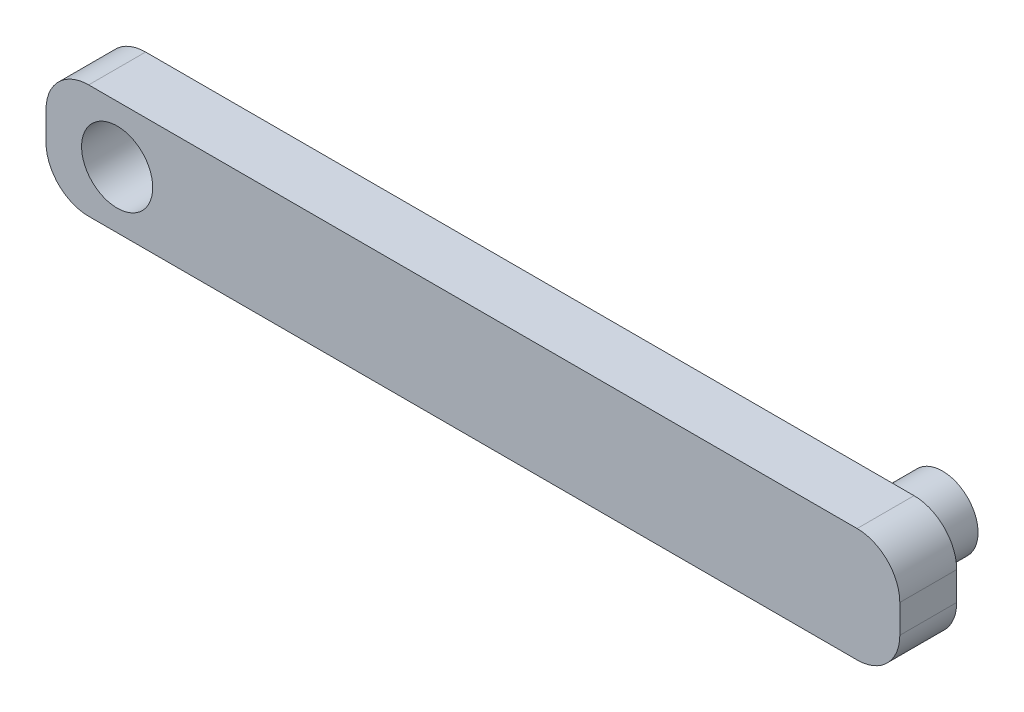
ISO-10303-21;
HEADER;
FILE_DESCRIPTION(('STEP AP214'),'2;1');
FILE_NAME('part.step','',(''),(''),'','','');
FILE_SCHEMA(('AUTOMOTIVE_DESIGN { 1 0 10303 214 1 1 1 1 }'));
ENDSEC;
DATA;
#1=APPLICATION_CONTEXT('core data for automotive mechanical design processes');
#2=APPLICATION_PROTOCOL_DEFINITION('international standard','automotive_design',2000,#1);
#3=PRODUCT_CONTEXT('',#1,'mechanical');
#4=PRODUCT('Part','Part','',(#3));
#5=PRODUCT_RELATED_PRODUCT_CATEGORY('part','',(#4));
#6=PRODUCT_DEFINITION_FORMATION('','',#4);
#7=PRODUCT_DEFINITION_CONTEXT('part definition',#1,'design');
#8=PRODUCT_DEFINITION('design','',#6,#7);
#9=PRODUCT_DEFINITION_SHAPE('','',#8);
#10=(LENGTH_UNIT() NAMED_UNIT(*) SI_UNIT(.MILLI.,.METRE.));
#11=(NAMED_UNIT(*) PLANE_ANGLE_UNIT() SI_UNIT($,.RADIAN.));
#12=(NAMED_UNIT(*) SI_UNIT($,.STERADIAN.) SOLID_ANGLE_UNIT());
#13=UNCERTAINTY_MEASURE_WITH_UNIT(LENGTH_MEASURE(1.E-05),#10,'distance_accuracy_value','');
#14=(GEOMETRIC_REPRESENTATION_CONTEXT(3) GLOBAL_UNCERTAINTY_ASSIGNED_CONTEXT((#13)) GLOBAL_UNIT_ASSIGNED_CONTEXT((#10,
#11,#12)) REPRESENTATION_CONTEXT('',''));
#15=CARTESIAN_POINT('',(0.,0.,0.));
#16=DIRECTION('',(0.,0.,1.));
#17=DIRECTION('',(1.,0.,0.));
#18=AXIS2_PLACEMENT_3D('',#15,#16,#17);
#19=CARTESIAN_POINT('',(996.866139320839,42.0947073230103,0.));
#20=DIRECTION('',(0.,0.,-1.));
#21=DIRECTION('',(-1.,0.,0.));
#22=AXIS2_PLACEMENT_3D('',#19,#20,#21);
#23=PLANE('',#22);
#24=CARTESIAN_POINT('',(996.866139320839,42.0947073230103,0.));
#25=DIRECTION('',(0.,0.,1.));
#26=DIRECTION('',(-1.,0.,0.));
#27=AXIS2_PLACEMENT_3D('',#24,#25,#26);
#28=CIRCLE('',#27,15.);
#29=CARTESIAN_POINT('',(1011.86613932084,42.0947073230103,0.));
#30=VERTEX_POINT('',#29);
#31=CARTESIAN_POINT('',(996.866139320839,57.0947073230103,0.));
#32=VERTEX_POINT('',#31);
#33=EDGE_CURVE('E102',#30,#32,#28,.T.);
#34=ORIENTED_EDGE('',*,*,#33,.F.);
#35=DIRECTION('',(0.,1.,0.));
#36=VECTOR('',#35,1.);
#37=CARTESIAN_POINT('',(1011.86613932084,42.0947073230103,0.));
#38=LINE('',#37,#36);
#39=CARTESIAN_POINT('',(1011.86613932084,32.0947073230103,0.));
#40=VERTEX_POINT('',#39);
#41=EDGE_CURVE('E132',#40,#30,#38,.T.);
#42=ORIENTED_EDGE('',*,*,#41,.F.);
#43=CARTESIAN_POINT('',(996.866139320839,32.0947073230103,0.));
#44=DIRECTION('',(0.,0.,1.));
#45=DIRECTION('',(1.,0.,0.));
#46=AXIS2_PLACEMENT_3D('',#43,#44,#45);
#47=CIRCLE('',#46,15.);
#48=CARTESIAN_POINT('',(996.866139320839,17.0947073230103,0.));
#49=VERTEX_POINT('',#48);
#50=EDGE_CURVE('E130',#49,#40,#47,.T.);
#51=ORIENTED_EDGE('',*,*,#50,.F.);
#52=DIRECTION('',(1.,0.,0.));
#53=VECTOR('',#52,1.);
#54=CARTESIAN_POINT('',(726.866139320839,17.0947073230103,0.));
#55=LINE('',#54,#53);
#56=CARTESIAN_POINT('',(726.866139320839,17.0947073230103,0.));
#57=VERTEX_POINT('',#56);
#58=EDGE_CURVE('E128',#57,#49,#55,.T.);
#59=ORIENTED_EDGE('',*,*,#58,.F.);
#60=CARTESIAN_POINT('',(726.866139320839,32.0947073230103,0.));
#61=DIRECTION('',(0.,0.,1.));
#62=DIRECTION('',(1.,0.,0.));
#63=AXIS2_PLACEMENT_3D('',#60,#61,#62);
#64=CIRCLE('',#63,15.);
#65=CARTESIAN_POINT('',(711.866139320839,32.0947073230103,0.));
#66=VERTEX_POINT('',#65);
#67=EDGE_CURVE('E126',#66,#57,#64,.T.);
#68=ORIENTED_EDGE('',*,*,#67,.F.);
#69=DIRECTION('',(0.,-1.,0.));
#70=VECTOR('',#69,1.);
#71=CARTESIAN_POINT('',(711.866139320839,42.0947073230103,0.));
#72=LINE('',#71,#70);
#73=CARTESIAN_POINT('',(711.866139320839,42.0947073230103,0.));
#74=VERTEX_POINT('',#73);
#75=EDGE_CURVE('E124',#74,#66,#72,.T.);
#76=ORIENTED_EDGE('',*,*,#75,.F.);
#77=CARTESIAN_POINT('',(726.866139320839,42.0947073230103,0.));
#78=DIRECTION('',(0.,0.,1.));
#79=DIRECTION('',(1.,0.,0.));
#80=AXIS2_PLACEMENT_3D('',#77,#78,#79);
#81=CIRCLE('',#80,15.);
#82=CARTESIAN_POINT('',(726.866139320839,57.0947073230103,0.));
#83=VERTEX_POINT('',#82);
#84=EDGE_CURVE('E104',#83,#74,#81,.T.);
#85=ORIENTED_EDGE('',*,*,#84,.F.);
#86=DIRECTION('',(-1.,0.,0.));
#87=VECTOR('',#86,1.);
#88=CARTESIAN_POINT('',(726.866139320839,57.0947073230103,0.));
#89=LINE('',#88,#87);
#90=EDGE_CURVE('E98',#32,#83,#89,.T.);
#91=ORIENTED_EDGE('',*,*,#90,.F.);
#92=EDGE_LOOP('',(#34,#42,#51,#59,#68,#76,#85,#91));
#93=FACE_BOUND('',#92,.T.);
#94=CARTESIAN_POINT('',(736.866139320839,37.0947073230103,0.));
#95=DIRECTION('',(0.,0.,1.));
#96=DIRECTION('',(1.,0.,0.));
#97=AXIS2_PLACEMENT_3D('',#94,#95,#96);
#98=CIRCLE('',#97,12.5);
#99=CARTESIAN_POINT('',(749.366139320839,37.0947073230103,0.));
#100=VERTEX_POINT('',#99);
#101=EDGE_CURVE('E116',#100,#100,#98,.T.);
#102=ORIENTED_EDGE('',*,*,#101,.T.);
#103=EDGE_LOOP('',(#102));
#104=FACE_BOUND('',#103,.T.);
#105=CARTESIAN_POINT('',(986.866139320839,37.0947073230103,0.));
#106=DIRECTION('',(0.,0.,-1.));
#107=DIRECTION('',(-1.,0.,0.));
#108=AXIS2_PLACEMENT_3D('',#105,#106,#107);
#109=CIRCLE('',#108,12.5);
#110=CARTESIAN_POINT('',(974.366139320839,37.0947073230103,0.));
#111=VERTEX_POINT('',#110);
#112=EDGE_CURVE('E217',#111,#111,#109,.T.);
#113=ORIENTED_EDGE('',*,*,#112,.F.);
#114=EDGE_LOOP('',(#113));
#115=FACE_BOUND('',#114,.T.);
#116=ADVANCED_FACE('F33',(#93,#104,#115),#23,.T.);
#117=CARTESIAN_POINT('',(996.866139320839,42.0947073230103,20.));
#118=DIRECTION('',(0.,0.,-1.));
#119=DIRECTION('',(-1.,0.,0.));
#120=AXIS2_PLACEMENT_3D('',#117,#118,#119);
#121=CYLINDRICAL_SURFACE('',#120,15.);
#122=ORIENTED_EDGE('',*,*,#33,.T.);
#123=DIRECTION('',(0.,0.,-1.));
#124=VECTOR('',#123,1.);
#125=CARTESIAN_POINT('',(996.866139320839,57.0947073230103,20.));
#126=LINE('',#125,#124);
#127=CARTESIAN_POINT('',(996.866139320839,57.0947073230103,20.));
#128=VERTEX_POINT('',#127);
#129=EDGE_CURVE('E11',#128,#32,#126,.T.);
#130=ORIENTED_EDGE('',*,*,#129,.F.);
#131=CARTESIAN_POINT('',(996.866139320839,42.0947073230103,20.));
#132=DIRECTION('',(0.,0.,1.));
#133=DIRECTION('',(-1.,0.,0.));
#134=AXIS2_PLACEMENT_3D('',#131,#132,#133);
#135=CIRCLE('',#134,15.);
#136=CARTESIAN_POINT('',(1011.86613932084,42.0947073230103,20.));
#137=VERTEX_POINT('',#136);
#138=EDGE_CURVE('E134',#137,#128,#135,.T.);
#139=ORIENTED_EDGE('',*,*,#138,.F.);
#140=DIRECTION('',(0.,0.,-1.));
#141=VECTOR('',#140,1.);
#142=CARTESIAN_POINT('',(1011.86613932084,42.0947073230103,20.));
#143=LINE('',#142,#141);
#144=EDGE_CURVE('E115',#137,#30,#143,.T.);
#145=ORIENTED_EDGE('',*,*,#144,.T.);
#146=EDGE_LOOP('',(#122,#130,#139,#145));
#147=FACE_BOUND('',#146,.T.);
#148=ADVANCED_FACE('F35',(#147),#121,.T.);
#149=CARTESIAN_POINT('',(726.866139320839,57.0947073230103,20.));
#150=DIRECTION('',(0.,-1.,0.));
#151=DIRECTION('',(1.,0.,0.));
#152=AXIS2_PLACEMENT_3D('',#149,#150,#151);
#153=PLANE('',#152);
#154=ORIENTED_EDGE('',*,*,#90,.T.);
#155=DIRECTION('',(0.,0.,-1.));
#156=VECTOR('',#155,1.);
#157=CARTESIAN_POINT('',(726.866139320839,57.0947073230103,20.));
#158=LINE('',#157,#156);
#159=CARTESIAN_POINT('',(726.866139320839,57.0947073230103,20.));
#160=VERTEX_POINT('',#159);
#161=EDGE_CURVE('E41',#160,#83,#158,.T.);
#162=ORIENTED_EDGE('',*,*,#161,.F.);
#163=DIRECTION('',(-1.,0.,0.));
#164=VECTOR('',#163,1.);
#165=CARTESIAN_POINT('',(726.866139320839,57.0947073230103,20.));
#166=LINE('',#165,#164);
#167=EDGE_CURVE('E111',#128,#160,#166,.T.);
#168=ORIENTED_EDGE('',*,*,#167,.F.);
#169=ORIENTED_EDGE('',*,*,#129,.T.);
#170=EDGE_LOOP('',(#154,#162,#168,#169));
#171=FACE_BOUND('',#170,.T.);
#172=ADVANCED_FACE('F110',(#171),#153,.F.);
#173=CARTESIAN_POINT('',(726.866139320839,42.0947073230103,20.));
#174=DIRECTION('',(0.,0.,-1.));
#175=DIRECTION('',(-1.,0.,0.));
#176=AXIS2_PLACEMENT_3D('',#173,#174,#175);
#177=CYLINDRICAL_SURFACE('',#176,15.);
#178=ORIENTED_EDGE('',*,*,#84,.T.);
#179=DIRECTION('',(0.,0.,-1.));
#180=VECTOR('',#179,1.);
#181=CARTESIAN_POINT('',(711.866139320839,42.0947073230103,20.));
#182=LINE('',#181,#180);
#183=CARTESIAN_POINT('',(711.866139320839,42.0947073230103,20.));
#184=VERTEX_POINT('',#183);
#185=EDGE_CURVE('E160',#184,#74,#182,.T.);
#186=ORIENTED_EDGE('',*,*,#185,.F.);
#187=CARTESIAN_POINT('',(726.866139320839,42.0947073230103,20.));
#188=DIRECTION('',(0.,0.,1.));
#189=DIRECTION('',(1.,0.,0.));
#190=AXIS2_PLACEMENT_3D('',#187,#188,#189);
#191=CIRCLE('',#190,15.);
#192=EDGE_CURVE('E137',#160,#184,#191,.T.);
#193=ORIENTED_EDGE('',*,*,#192,.F.);
#194=ORIENTED_EDGE('',*,*,#161,.T.);
#195=EDGE_LOOP('',(#178,#186,#193,#194));
#196=FACE_BOUND('',#195,.T.);
#197=ADVANCED_FACE('F164',(#196),#177,.T.);
#198=CARTESIAN_POINT('',(711.866139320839,42.0947073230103,20.));
#199=DIRECTION('',(1.,0.,0.));
#200=DIRECTION('',(0.,0.,-1.));
#201=AXIS2_PLACEMENT_3D('',#198,#199,#200);
#202=PLANE('',#201);
#203=ORIENTED_EDGE('',*,*,#75,.T.);
#204=DIRECTION('',(0.,0.,-1.));
#205=VECTOR('',#204,1.);
#206=CARTESIAN_POINT('',(711.866139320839,32.0947073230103,20.));
#207=LINE('',#206,#205);
#208=CARTESIAN_POINT('',(711.866139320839,32.0947073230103,20.));
#209=VERTEX_POINT('',#208);
#210=EDGE_CURVE('E157',#209,#66,#207,.T.);
#211=ORIENTED_EDGE('',*,*,#210,.F.);
#212=DIRECTION('',(0.,-1.,0.));
#213=VECTOR('',#212,1.);
#214=CARTESIAN_POINT('',(711.866139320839,42.0947073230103,20.));
#215=LINE('',#214,#213);
#216=EDGE_CURVE('E139',#184,#209,#215,.T.);
#217=ORIENTED_EDGE('',*,*,#216,.F.);
#218=ORIENTED_EDGE('',*,*,#185,.T.);
#219=EDGE_LOOP('',(#203,#211,#217,#218));
#220=FACE_BOUND('',#219,.T.);
#221=ADVANCED_FACE('F172',(#220),#202,.F.);
#222=CARTESIAN_POINT('',(726.866139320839,32.0947073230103,20.));
#223=DIRECTION('',(0.,0.,-1.));
#224=DIRECTION('',(-1.,0.,0.));
#225=AXIS2_PLACEMENT_3D('',#222,#223,#224);
#226=CYLINDRICAL_SURFACE('',#225,15.);
#227=ORIENTED_EDGE('',*,*,#67,.T.);
#228=DIRECTION('',(0.,0.,-1.));
#229=VECTOR('',#228,1.);
#230=CARTESIAN_POINT('',(726.866139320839,17.0947073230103,20.));
#231=LINE('',#230,#229);
#232=CARTESIAN_POINT('',(726.866139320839,17.0947073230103,20.));
#233=VERTEX_POINT('',#232);
#234=EDGE_CURVE('E154',#233,#57,#231,.T.);
#235=ORIENTED_EDGE('',*,*,#234,.F.);
#236=CARTESIAN_POINT('',(726.866139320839,32.0947073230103,20.));
#237=DIRECTION('',(0.,0.,1.));
#238=DIRECTION('',(1.,0.,0.));
#239=AXIS2_PLACEMENT_3D('',#236,#237,#238);
#240=CIRCLE('',#239,15.);
#241=EDGE_CURVE('E141',#209,#233,#240,.T.);
#242=ORIENTED_EDGE('',*,*,#241,.F.);
#243=ORIENTED_EDGE('',*,*,#210,.T.);
#244=EDGE_LOOP('',(#227,#235,#242,#243));
#245=FACE_BOUND('',#244,.T.);
#246=ADVANCED_FACE('F175',(#245),#226,.T.);
#247=CARTESIAN_POINT('',(726.866139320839,17.0947073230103,20.));
#248=DIRECTION('',(0.,1.,0.));
#249=DIRECTION('',(-1.,0.,0.));
#250=AXIS2_PLACEMENT_3D('',#247,#248,#249);
#251=PLANE('',#250);
#252=ORIENTED_EDGE('',*,*,#58,.T.);
#253=DIRECTION('',(0.,0.,-1.));
#254=VECTOR('',#253,1.);
#255=CARTESIAN_POINT('',(996.866139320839,17.0947073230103,20.));
#256=LINE('',#255,#254);
#257=CARTESIAN_POINT('',(996.866139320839,17.0947073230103,20.));
#258=VERTEX_POINT('',#257);
#259=EDGE_CURVE('E151',#258,#49,#256,.T.);
#260=ORIENTED_EDGE('',*,*,#259,.F.);
#261=DIRECTION('',(1.,0.,0.));
#262=VECTOR('',#261,1.);
#263=CARTESIAN_POINT('',(726.866139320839,17.0947073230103,20.));
#264=LINE('',#263,#262);
#265=EDGE_CURVE('E143',#233,#258,#264,.T.);
#266=ORIENTED_EDGE('',*,*,#265,.F.);
#267=ORIENTED_EDGE('',*,*,#234,.T.);
#268=EDGE_LOOP('',(#252,#260,#266,#267));
#269=FACE_BOUND('',#268,.T.);
#270=ADVANCED_FACE('F180',(#269),#251,.F.);
#271=CARTESIAN_POINT('',(996.866139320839,32.0947073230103,20.));
#272=DIRECTION('',(0.,0.,-1.));
#273=DIRECTION('',(-1.,0.,0.));
#274=AXIS2_PLACEMENT_3D('',#271,#272,#273);
#275=CYLINDRICAL_SURFACE('',#274,15.);
#276=ORIENTED_EDGE('',*,*,#50,.T.);
#277=DIRECTION('',(0.,0.,-1.));
#278=VECTOR('',#277,1.);
#279=CARTESIAN_POINT('',(1011.86613932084,32.0947073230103,20.));
#280=LINE('',#279,#278);
#281=CARTESIAN_POINT('',(1011.86613932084,32.0947073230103,20.));
#282=VERTEX_POINT('',#281);
#283=EDGE_CURVE('E148',#282,#40,#280,.T.);
#284=ORIENTED_EDGE('',*,*,#283,.F.);
#285=CARTESIAN_POINT('',(996.866139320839,32.0947073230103,20.));
#286=DIRECTION('',(0.,0.,1.));
#287=DIRECTION('',(1.,0.,0.));
#288=AXIS2_PLACEMENT_3D('',#285,#286,#287);
#289=CIRCLE('',#288,15.);
#290=EDGE_CURVE('E53',#258,#282,#289,.T.);
#291=ORIENTED_EDGE('',*,*,#290,.F.);
#292=ORIENTED_EDGE('',*,*,#259,.T.);
#293=EDGE_LOOP('',(#276,#284,#291,#292));
#294=FACE_BOUND('',#293,.T.);
#295=ADVANCED_FACE('F183',(#294),#275,.T.);
#296=CARTESIAN_POINT('',(1011.86613932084,42.0947073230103,20.));
#297=DIRECTION('',(-1.,0.,0.));
#298=DIRECTION('',(0.,0.,1.));
#299=AXIS2_PLACEMENT_3D('',#296,#297,#298);
#300=PLANE('',#299);
#301=ORIENTED_EDGE('',*,*,#41,.T.);
#302=ORIENTED_EDGE('',*,*,#144,.F.);
#303=DIRECTION('',(0.,1.,0.));
#304=VECTOR('',#303,1.);
#305=CARTESIAN_POINT('',(1011.86613932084,42.0947073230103,20.));
#306=LINE('',#305,#304);
#307=EDGE_CURVE('E48',#282,#137,#306,.T.);
#308=ORIENTED_EDGE('',*,*,#307,.F.);
#309=ORIENTED_EDGE('',*,*,#283,.T.);
#310=EDGE_LOOP('',(#301,#302,#308,#309));
#311=FACE_BOUND('',#310,.T.);
#312=ADVANCED_FACE('F185',(#311),#300,.F.);
#313=CARTESIAN_POINT('',(996.866139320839,42.0947073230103,20.));
#314=DIRECTION('',(0.,0.,-1.));
#315=DIRECTION('',(-1.,0.,0.));
#316=AXIS2_PLACEMENT_3D('',#313,#314,#315);
#317=PLANE('',#316);
#318=CARTESIAN_POINT('',(736.866139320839,37.0947073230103,20.));
#319=DIRECTION('',(0.,0.,1.));
#320=DIRECTION('',(1.,0.,0.));
#321=AXIS2_PLACEMENT_3D('',#318,#319,#320);
#322=CIRCLE('',#321,12.5);
#323=CARTESIAN_POINT('',(749.366139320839,37.0947073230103,20.));
#324=VERTEX_POINT('',#323);
#325=EDGE_CURVE('E119',#324,#324,#322,.T.);
#326=ORIENTED_EDGE('',*,*,#325,.F.);
#327=EDGE_LOOP('',(#326));
#328=FACE_BOUND('',#327,.T.);
#329=ORIENTED_EDGE('',*,*,#138,.T.);
#330=ORIENTED_EDGE('',*,*,#167,.T.);
#331=ORIENTED_EDGE('',*,*,#192,.T.);
#332=ORIENTED_EDGE('',*,*,#216,.T.);
#333=ORIENTED_EDGE('',*,*,#241,.T.);
#334=ORIENTED_EDGE('',*,*,#265,.T.);
#335=ORIENTED_EDGE('',*,*,#290,.T.);
#336=ORIENTED_EDGE('',*,*,#307,.T.);
#337=EDGE_LOOP('',(#329,#330,#331,#332,#333,#334,#335,#336));
#338=FACE_BOUND('',#337,.T.);
#339=ADVANCED_FACE('F167',(#328,#338),#317,.F.);
#340=CARTESIAN_POINT('',(736.866139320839,37.0947073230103,0.));
#341=DIRECTION('',(0.,0.,1.));
#342=DIRECTION('',(1.,0.,0.));
#343=AXIS2_PLACEMENT_3D('',#340,#341,#342);
#344=CYLINDRICAL_SURFACE('',#343,12.5);
#345=ORIENTED_EDGE('',*,*,#101,.F.);
#346=EDGE_LOOP('',(#345));
#347=FACE_BOUND('',#346,.T.);
#348=ORIENTED_EDGE('',*,*,#325,.T.);
#349=EDGE_LOOP('',(#348));
#350=FACE_BOUND('',#349,.T.);
#351=ADVANCED_FACE('F192',(#347,#350),#344,.F.);
#352=CARTESIAN_POINT('',(986.866139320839,37.0947073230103,-20.));
#353=DIRECTION('',(0.,0.,1.));
#354=DIRECTION('',(1.,0.,0.));
#355=AXIS2_PLACEMENT_3D('',#352,#353,#354);
#356=CYLINDRICAL_SURFACE('',#355,12.5);
#357=CARTESIAN_POINT('',(986.866139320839,37.0947073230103,-20.));
#358=DIRECTION('',(0.,0.,-1.));
#359=DIRECTION('',(-1.,0.,0.));
#360=AXIS2_PLACEMENT_3D('',#357,#358,#359);
#361=CIRCLE('',#360,12.5);
#362=CARTESIAN_POINT('',(974.366139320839,37.0947073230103,-20.));
#363=VERTEX_POINT('',#362);
#364=EDGE_CURVE('E216',#363,#363,#361,.T.);
#365=ORIENTED_EDGE('',*,*,#364,.F.);
#366=EDGE_LOOP('',(#365));
#367=FACE_BOUND('',#366,.T.);
#368=ORIENTED_EDGE('',*,*,#112,.T.);
#369=EDGE_LOOP('',(#368));
#370=FACE_BOUND('',#369,.T.);
#371=ADVANCED_FACE('F204',(#367,#370),#356,.T.);
#372=CARTESIAN_POINT('',(986.866139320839,37.0947073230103,-20.));
#373=DIRECTION('',(0.,0.,-1.));
#374=DIRECTION('',(-1.,0.,0.));
#375=AXIS2_PLACEMENT_3D('',#372,#373,#374);
#376=PLANE('',#375);
#377=ORIENTED_EDGE('',*,*,#364,.T.);
#378=EDGE_LOOP('',(#377));
#379=FACE_BOUND('',#378,.T.);
#380=ADVANCED_FACE('F208',(#379),#376,.T.);
#381=CLOSED_SHELL('',(#116,#148,#172,#197,#221,#246,#270,#295,#312,#339,#351,#371,#380));
#382=MANIFOLD_SOLID_BREP('B2',#381);
#383=ADVANCED_BREP_SHAPE_REPRESENTATION('',(#18,#382),#14);
#384=SHAPE_DEFINITION_REPRESENTATION(#9,#383);
ENDSEC;
END-ISO-10303-21;
